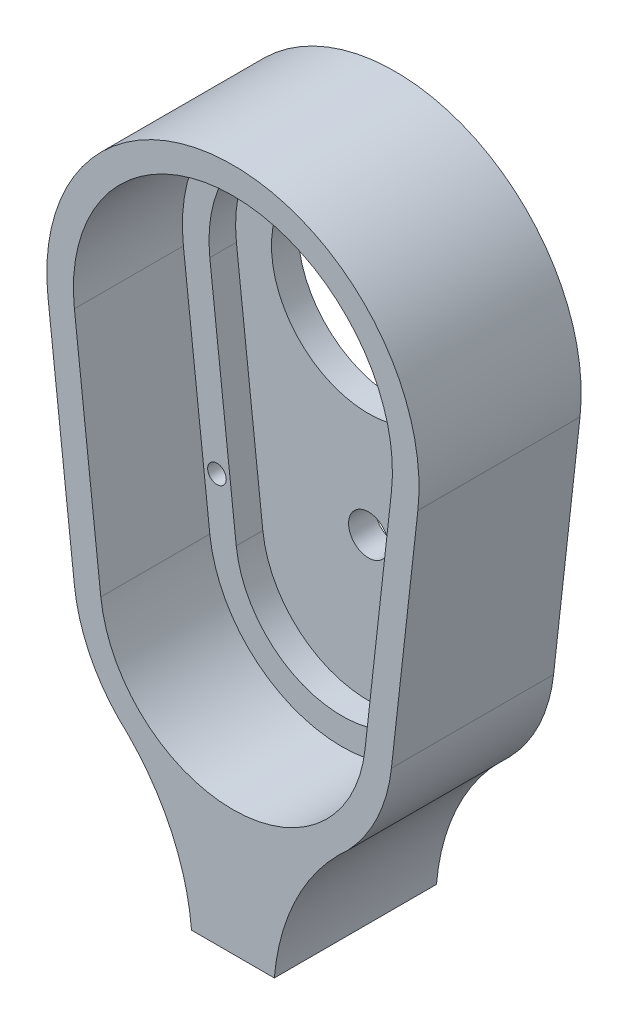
ISO-10303-21;
HEADER;
FILE_DESCRIPTION(('STEP AP214'),'2;1');
FILE_NAME('part.step','',(''),(''),'','','');
FILE_SCHEMA(('AUTOMOTIVE_DESIGN { 1 0 10303 214 1 1 1 1 }'));
ENDSEC;
DATA;
#1=APPLICATION_CONTEXT('core data for automotive mechanical design processes');
#2=APPLICATION_PROTOCOL_DEFINITION('international standard','automotive_design',2000,#1);
#3=PRODUCT_CONTEXT('',#1,'mechanical');
#4=PRODUCT('Part','Part','',(#3));
#5=PRODUCT_RELATED_PRODUCT_CATEGORY('part','',(#4));
#6=PRODUCT_DEFINITION_FORMATION('','',#4);
#7=PRODUCT_DEFINITION_CONTEXT('part definition',#1,'design');
#8=PRODUCT_DEFINITION('design','',#6,#7);
#9=PRODUCT_DEFINITION_SHAPE('','',#8);
#10=(LENGTH_UNIT() NAMED_UNIT(*) SI_UNIT(.MILLI.,.METRE.));
#11=(NAMED_UNIT(*) PLANE_ANGLE_UNIT() SI_UNIT($,.RADIAN.));
#12=(NAMED_UNIT(*) SI_UNIT($,.STERADIAN.) SOLID_ANGLE_UNIT());
#13=UNCERTAINTY_MEASURE_WITH_UNIT(LENGTH_MEASURE(1.E-05),#10,'distance_accuracy_value','');
#14=(GEOMETRIC_REPRESENTATION_CONTEXT(3) GLOBAL_UNCERTAINTY_ASSIGNED_CONTEXT((#13)) GLOBAL_UNIT_ASSIGNED_CONTEXT((#10,
#11,#12)) REPRESENTATION_CONTEXT('',''));
#15=CARTESIAN_POINT('',(0.,0.,0.));
#16=DIRECTION('',(0.,0.,1.));
#17=DIRECTION('',(1.,0.,0.));
#18=AXIS2_PLACEMENT_3D('',#15,#16,#17);
#19=CARTESIAN_POINT('',(0.,-22.86,15.494));
#20=DIRECTION('',(0.,0.,-1.));
#21=DIRECTION('',(-1.,0.,0.));
#22=AXIS2_PLACEMENT_3D('',#19,#20,#21);
#23=CYLINDRICAL_SURFACE('',#22,15.24);
#24=DIRECTION('',(0.,0.,-1.));
#25=VECTOR('',#24,1.);
#26=CARTESIAN_POINT('',(-10.046563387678,-34.319675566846,7.747));
#27=LINE('',#26,#25);
#28=CARTESIAN_POINT('',(-10.046563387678,-34.319675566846,15.494));
#29=VERTEX_POINT('',#28);
#30=CARTESIAN_POINT('',(-10.046563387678,-34.319675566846,0.));
#31=VERTEX_POINT('',#30);
#32=EDGE_CURVE('E62',#29,#31,#27,.T.);
#33=ORIENTED_EDGE('',*,*,#32,.F.);
#34=CARTESIAN_POINT('',(0.,-22.86,15.494));
#35=DIRECTION('',(0.,0.,1.));
#36=DIRECTION('',(1.,0.,0.));
#37=AXIS2_PLACEMENT_3D('',#34,#35,#36);
#38=CIRCLE('',#37,15.24);
#39=CARTESIAN_POINT('',(-15.1456337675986,-24.5533333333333,15.494));
#40=VERTEX_POINT('',#39);
#41=EDGE_CURVE('E265',#40,#29,#38,.T.);
#42=ORIENTED_EDGE('',*,*,#41,.F.);
#43=DIRECTION('',(0.,0.,-1.));
#44=VECTOR('',#43,1.);
#45=CARTESIAN_POINT('',(-15.1456337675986,-24.5533333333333,15.494));
#46=LINE('',#45,#44);
#47=CARTESIAN_POINT('',(-15.1456337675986,-24.5533333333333,0.));
#48=VERTEX_POINT('',#47);
#49=EDGE_CURVE('E46',#40,#48,#46,.T.);
#50=ORIENTED_EDGE('',*,*,#49,.T.);
#51=CARTESIAN_POINT('',(0.,-22.86,0.));
#52=DIRECTION('',(0.,0.,1.));
#53=DIRECTION('',(1.,0.,0.));
#54=AXIS2_PLACEMENT_3D('',#51,#52,#53);
#55=CIRCLE('',#54,15.24);
#56=EDGE_CURVE('E276',#48,#31,#55,.T.);
#57=ORIENTED_EDGE('',*,*,#56,.T.);
#58=EDGE_LOOP('',(#33,#42,#50,#57));
#59=FACE_BOUND('',#58,.T.);
#60=ADVANCED_FACE('F37',(#59),#23,.T.);
#61=CARTESIAN_POINT('',(0.,0.,2.54));
#62=DIRECTION('',(0.,0.,1.));
#63=DIRECTION('',(1.,0.,0.));
#64=AXIS2_PLACEMENT_3D('',#61,#62,#63);
#65=PLANE('',#64);
#66=CARTESIAN_POINT('',(0.,-19.304,2.54));
#67=DIRECTION('',(0.,0.,1.));
#68=DIRECTION('',(1.,0.,0.));
#69=AXIS2_PLACEMENT_3D('',#66,#67,#68);
#70=CIRCLE('',#69,1.905);
#71=CARTESIAN_POINT('',(1.905,-19.304,2.54));
#72=VERTEX_POINT('',#71);
#73=EDGE_CURVE('E665',#72,#72,#70,.T.);
#74=ORIENTED_EDGE('',*,*,#73,.F.);
#75=EDGE_LOOP('',(#74));
#76=FACE_BOUND('',#75,.T.);
#77=CARTESIAN_POINT('',(0.,0.,2.54));
#78=DIRECTION('',(0.,0.,1.));
#79=DIRECTION('',(1.,0.,0.));
#80=AXIS2_PLACEMENT_3D('',#77,#78,#79);
#81=CIRCLE('',#80,9.271);
#82=CARTESIAN_POINT('',(9.271,0.,2.54));
#83=VERTEX_POINT('',#82);
#84=EDGE_CURVE('E236',#83,#83,#81,.T.);
#85=ORIENTED_EDGE('',*,*,#84,.F.);
#86=EDGE_LOOP('',(#85));
#87=FACE_BOUND('',#86,.T.);
#88=CARTESIAN_POINT('',(0.,-22.86,2.54));
#89=DIRECTION('',(0.,0.,1.));
#90=DIRECTION('',(1.,0.,0.));
#91=AXIS2_PLACEMENT_3D('',#88,#89,#90);
#92=CIRCLE('',#91,10.16);
#93=CARTESIAN_POINT('',(-10.097089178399,-23.9888888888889,2.54));
#94=VERTEX_POINT('',#93);
#95=CARTESIAN_POINT('',(10.0970891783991,-23.9888888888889,2.54));
#96=VERTEX_POINT('',#95);
#97=EDGE_CURVE('E219',#94,#96,#92,.T.);
#98=ORIENTED_EDGE('',*,*,#97,.T.);
#99=DIRECTION('',(-0.111111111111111,-0.993807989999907,0.));
#100=VECTOR('',#99,1.);
#101=CARTESIAN_POINT('',(12.6213614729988,-1.41111111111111,2.54));
#102=LINE('',#101,#100);
#103=CARTESIAN_POINT('',(12.6213614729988,-1.4111111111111,2.54));
#104=VERTEX_POINT('',#103);
#105=EDGE_CURVE('E185',#104,#96,#102,.T.);
#106=ORIENTED_EDGE('',*,*,#105,.F.);
#107=CARTESIAN_POINT('',(0.,0.,2.54));
#108=DIRECTION('',(0.,0.,1.));
#109=DIRECTION('',(1.,0.,0.));
#110=AXIS2_PLACEMENT_3D('',#107,#108,#109);
#111=CIRCLE('',#110,12.7);
#112=CARTESIAN_POINT('',(-12.6213614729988,-1.41111111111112,2.54));
#113=VERTEX_POINT('',#112);
#114=EDGE_CURVE('E189',#104,#113,#111,.T.);
#115=ORIENTED_EDGE('',*,*,#114,.T.);
#116=DIRECTION('',(0.111111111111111,-0.993807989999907,0.));
#117=VECTOR('',#116,1.);
#118=CARTESIAN_POINT('',(-12.6213614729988,-1.41111111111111,2.54));
#119=LINE('',#118,#117);
#120=EDGE_CURVE('E221',#113,#94,#119,.T.);
#121=ORIENTED_EDGE('',*,*,#120,.T.);
#122=EDGE_LOOP('',(#98,#106,#115,#121));
#123=FACE_BOUND('',#122,.T.);
#124=ADVANCED_FACE('F317',(#76,#87,#123),#65,.T.);
#125=CARTESIAN_POINT('',(0.,0.,15.494));
#126=DIRECTION('',(0.,0.,-1.));
#127=DIRECTION('',(-1.,0.,0.));
#128=AXIS2_PLACEMENT_3D('',#125,#126,#127);
#129=CYLINDRICAL_SURFACE('',#128,17.78);
#130=CARTESIAN_POINT('',(0.,0.,0.));
#131=DIRECTION('',(0.,0.,1.));
#132=DIRECTION('',(1.,0.,0.));
#133=AXIS2_PLACEMENT_3D('',#130,#131,#132);
#134=CIRCLE('',#133,17.78);
#135=CARTESIAN_POINT('',(17.6699060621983,-1.97555555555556,0.));
#136=VERTEX_POINT('',#135);
#137=CARTESIAN_POINT('',(-17.6699060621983,-1.97555555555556,0.));
#138=VERTEX_POINT('',#137);
#139=EDGE_CURVE('E239',#136,#138,#134,.T.);
#140=ORIENTED_EDGE('',*,*,#139,.T.);
#141=DIRECTION('',(0.,0.,-1.));
#142=VECTOR('',#141,1.);
#143=CARTESIAN_POINT('',(-17.6699060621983,-1.97555555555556,15.494));
#144=LINE('',#143,#142);
#145=CARTESIAN_POINT('',(-17.6699060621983,-1.97555555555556,15.494));
#146=VERTEX_POINT('',#145);
#147=EDGE_CURVE('E11',#146,#138,#144,.T.);
#148=ORIENTED_EDGE('',*,*,#147,.F.);
#149=CARTESIAN_POINT('',(0.,0.,15.494));
#150=DIRECTION('',(0.,0.,1.));
#151=DIRECTION('',(1.,0.,0.));
#152=AXIS2_PLACEMENT_3D('',#149,#150,#151);
#153=CIRCLE('',#152,17.78);
#154=CARTESIAN_POINT('',(17.6699060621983,-1.97555555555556,15.494));
#155=VERTEX_POINT('',#154);
#156=EDGE_CURVE('E260',#155,#146,#153,.T.);
#157=ORIENTED_EDGE('',*,*,#156,.F.);
#158=DIRECTION('',(0.,0.,-1.));
#159=VECTOR('',#158,1.);
#160=CARTESIAN_POINT('',(17.6699060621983,-1.97555555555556,15.494));
#161=LINE('',#160,#159);
#162=EDGE_CURVE('E280',#155,#136,#161,.T.);
#163=ORIENTED_EDGE('',*,*,#162,.T.);
#164=EDGE_LOOP('',(#140,#148,#157,#163));
#165=FACE_BOUND('',#164,.T.);
#166=ADVANCED_FACE('F321',(#165),#129,.T.);
#167=CARTESIAN_POINT('',(-17.6699060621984,-1.97555555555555,15.494));
#168=DIRECTION('',(0.993807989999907,0.111111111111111,0.));
#169=DIRECTION('',(-0.111111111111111,0.993807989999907,0.));
#170=AXIS2_PLACEMENT_3D('',#167,#168,#169);
#171=PLANE('',#170);
#172=DIRECTION('',(0.111111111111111,-0.993807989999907,0.));
#173=VECTOR('',#172,1.);
#174=CARTESIAN_POINT('',(-17.6699060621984,-1.97555555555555,0.));
#175=LINE('',#174,#173);
#176=EDGE_CURVE('E273',#138,#48,#175,.T.);
#177=ORIENTED_EDGE('',*,*,#176,.T.);
#178=ORIENTED_EDGE('',*,*,#49,.F.);
#179=DIRECTION('',(0.111111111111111,-0.993807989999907,0.));
#180=VECTOR('',#179,1.);
#181=CARTESIAN_POINT('',(-17.6699060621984,-1.97555555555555,15.494));
#182=LINE('',#181,#180);
#183=EDGE_CURVE('E263',#146,#40,#182,.T.);
#184=ORIENTED_EDGE('',*,*,#183,.F.);
#185=ORIENTED_EDGE('',*,*,#147,.T.);
#186=EDGE_LOOP('',(#177,#178,#184,#185));
#187=FACE_BOUND('',#186,.T.);
#188=ADVANCED_FACE('F314',(#187),#171,.F.);
#189=CARTESIAN_POINT('',(10.0465633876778,-34.3196755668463,15.494));
#190=VERTEX_POINT('',#189);
#191=CARTESIAN_POINT('',(15.1456337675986,-24.5533333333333,15.494));
#192=VERTEX_POINT('',#191);
#193=EDGE_CURVE('E54',#190,#192,#38,.T.);
#194=ORIENTED_EDGE('',*,*,#193,.F.);
#195=DIRECTION('',(0.,0.,-1.));
#196=VECTOR('',#195,1.);
#197=CARTESIAN_POINT('',(10.0465633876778,-34.3196755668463,7.747));
#198=LINE('',#197,#196);
#199=CARTESIAN_POINT('',(10.0465633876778,-34.3196755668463,0.));
#200=VERTEX_POINT('',#199);
#201=EDGE_CURVE('E161',#190,#200,#198,.T.);
#202=ORIENTED_EDGE('',*,*,#201,.T.);
#203=CARTESIAN_POINT('',(15.1456337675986,-24.5533333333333,0.));
#204=VERTEX_POINT('',#203);
#205=EDGE_CURVE('E275',#200,#204,#55,.T.);
#206=ORIENTED_EDGE('',*,*,#205,.T.);
#207=DIRECTION('',(0.,0.,-1.));
#208=VECTOR('',#207,1.);
#209=CARTESIAN_POINT('',(15.1456337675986,-24.5533333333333,15.494));
#210=LINE('',#209,#208);
#211=EDGE_CURVE('E282',#192,#204,#210,.T.);
#212=ORIENTED_EDGE('',*,*,#211,.F.);
#213=EDGE_LOOP('',(#194,#202,#206,#212));
#214=FACE_BOUND('',#213,.T.);
#215=ADVANCED_FACE('F309',(#214),#23,.T.);
#216=CARTESIAN_POINT('',(-15.1456337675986,-1.69333333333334,15.494));
#217=DIRECTION('',(0.993807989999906,0.111111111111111,0.));
#218=DIRECTION('',(-0.111111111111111,0.993807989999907,0.));
#219=AXIS2_PLACEMENT_3D('',#216,#217,#218);
#220=PLANE('',#219);
#221=DIRECTION('',(0.111111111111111,-0.993807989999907,0.));
#222=VECTOR('',#221,1.);
#223=CARTESIAN_POINT('',(-15.1456337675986,-1.69333333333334,5.08));
#224=LINE('',#223,#222);
#225=CARTESIAN_POINT('',(-15.1456337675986,-1.69333333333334,5.08));
#226=VERTEX_POINT('',#225);
#227=CARTESIAN_POINT('',(-12.6213614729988,-24.2711111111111,5.08));
#228=VERTEX_POINT('',#227);
#229=EDGE_CURVE('E213',#226,#228,#224,.T.);
#230=ORIENTED_EDGE('',*,*,#229,.F.);
#231=DIRECTION('',(0.,0.,-1.));
#232=VECTOR('',#231,1.);
#233=CARTESIAN_POINT('',(-15.1456337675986,-1.69333333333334,15.494));
#234=LINE('',#233,#232);
#235=CARTESIAN_POINT('',(-15.1456337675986,-1.69333333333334,15.494));
#236=VERTEX_POINT('',#235);
#237=EDGE_CURVE('E41',#236,#226,#234,.T.);
#238=ORIENTED_EDGE('',*,*,#237,.F.);
#239=DIRECTION('',(0.111111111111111,-0.993807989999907,0.));
#240=VECTOR('',#239,1.);
#241=CARTESIAN_POINT('',(-15.1456337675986,-1.69333333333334,15.494));
#242=LINE('',#241,#240);
#243=CARTESIAN_POINT('',(-12.6213614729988,-24.2711111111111,15.494));
#244=VERTEX_POINT('',#243);
#245=EDGE_CURVE('E248',#236,#244,#242,.T.);
#246=ORIENTED_EDGE('',*,*,#245,.T.);
#247=DIRECTION('',(0.,0.,-1.));
#248=VECTOR('',#247,1.);
#249=CARTESIAN_POINT('',(-12.6213614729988,-24.2711111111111,15.494));
#250=LINE('',#249,#248);
#251=EDGE_CURVE('E270',#244,#228,#250,.T.);
#252=ORIENTED_EDGE('',*,*,#251,.T.);
#253=EDGE_LOOP('',(#230,#238,#246,#252));
#254=FACE_BOUND('',#253,.T.);
#255=ADVANCED_FACE('F39',(#254),#220,.T.);
#256=CARTESIAN_POINT('',(0.,0.,15.494));
#257=DIRECTION('',(0.,0.,-1.));
#258=DIRECTION('',(-1.,0.,0.));
#259=AXIS2_PLACEMENT_3D('',#256,#257,#258);
#260=CYLINDRICAL_SURFACE('',#259,15.24);
#261=CARTESIAN_POINT('',(0.,0.,5.08));
#262=DIRECTION('',(0.,0.,1.));
#263=DIRECTION('',(1.,0.,0.));
#264=AXIS2_PLACEMENT_3D('',#261,#262,#263);
#265=CIRCLE('',#264,15.24);
#266=CARTESIAN_POINT('',(15.1456337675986,-1.69333333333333,5.08));
#267=VERTEX_POINT('',#266);
#268=EDGE_CURVE('E210',#267,#226,#265,.T.);
#269=ORIENTED_EDGE('',*,*,#268,.F.);
#270=DIRECTION('',(0.,0.,-1.));
#271=VECTOR('',#270,1.);
#272=CARTESIAN_POINT('',(15.1456337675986,-1.69333333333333,15.494));
#273=LINE('',#272,#271);
#274=CARTESIAN_POINT('',(15.1456337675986,-1.69333333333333,15.494));
#275=VERTEX_POINT('',#274);
#276=EDGE_CURVE('E290',#275,#267,#273,.T.);
#277=ORIENTED_EDGE('',*,*,#276,.F.);
#278=CARTESIAN_POINT('',(0.,0.,15.494));
#279=DIRECTION('',(0.,0.,1.));
#280=DIRECTION('',(1.,0.,0.));
#281=AXIS2_PLACEMENT_3D('',#278,#279,#280);
#282=CIRCLE('',#281,15.24);
#283=EDGE_CURVE('E251',#275,#236,#282,.T.);
#284=ORIENTED_EDGE('',*,*,#283,.T.);
#285=ORIENTED_EDGE('',*,*,#237,.T.);
#286=EDGE_LOOP('',(#269,#277,#284,#285));
#287=FACE_BOUND('',#286,.T.);
#288=ADVANCED_FACE('F297',(#287),#260,.F.);
#289=CARTESIAN_POINT('',(15.1456337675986,-1.69333333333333,15.494));
#290=DIRECTION('',(0.993807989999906,-0.111111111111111,0.));
#291=DIRECTION('',(0.111111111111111,0.993807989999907,0.));
#292=AXIS2_PLACEMENT_3D('',#289,#290,#291);
#293=PLANE('',#292);
#294=ORIENTED_EDGE('',*,*,#276,.T.);
#295=DIRECTION('',(0.111111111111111,0.993807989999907,0.));
#296=VECTOR('',#295,1.);
#297=CARTESIAN_POINT('',(15.1456337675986,-1.69333333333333,5.08));
#298=LINE('',#297,#296);
#299=CARTESIAN_POINT('',(12.6213614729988,-24.2711111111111,5.08));
#300=VERTEX_POINT('',#299);
#301=EDGE_CURVE('E207',#300,#267,#298,.T.);
#302=ORIENTED_EDGE('',*,*,#301,.F.);
#303=DIRECTION('',(0.,0.,-1.));
#304=VECTOR('',#303,1.);
#305=CARTESIAN_POINT('',(12.6213614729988,-24.2711111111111,15.494));
#306=LINE('',#305,#304);
#307=CARTESIAN_POINT('',(12.6213614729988,-24.2711111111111,15.494));
#308=VERTEX_POINT('',#307);
#309=EDGE_CURVE('E289',#308,#300,#306,.T.);
#310=ORIENTED_EDGE('',*,*,#309,.F.);
#311=DIRECTION('',(-0.111111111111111,-0.993807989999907,0.));
#312=VECTOR('',#311,1.);
#313=CARTESIAN_POINT('',(15.1456337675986,-1.69333333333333,15.494));
#314=LINE('',#313,#312);
#315=EDGE_CURVE('E255',#275,#308,#314,.T.);
#316=ORIENTED_EDGE('',*,*,#315,.F.);
#317=EDGE_LOOP('',(#294,#302,#310,#316));
#318=FACE_BOUND('',#317,.T.);
#319=ADVANCED_FACE('F304',(#318),#293,.F.);
#320=CARTESIAN_POINT('',(0.,-22.86,15.494));
#321=DIRECTION('',(0.,0.,-1.));
#322=DIRECTION('',(-1.,0.,0.));
#323=AXIS2_PLACEMENT_3D('',#320,#321,#322);
#324=CYLINDRICAL_SURFACE('',#323,12.7);
#325=CARTESIAN_POINT('',(0.,-22.86,5.08));
#326=DIRECTION('',(0.,0.,1.));
#327=DIRECTION('',(1.,0.,0.));
#328=AXIS2_PLACEMENT_3D('',#325,#326,#327);
#329=CIRCLE('',#328,12.7);
#330=EDGE_CURVE('E204',#228,#300,#329,.T.);
#331=ORIENTED_EDGE('',*,*,#330,.F.);
#332=ORIENTED_EDGE('',*,*,#251,.F.);
#333=CARTESIAN_POINT('',(0.,-22.86,15.494));
#334=DIRECTION('',(0.,0.,1.));
#335=DIRECTION('',(1.,0.,0.));
#336=AXIS2_PLACEMENT_3D('',#333,#334,#335);
#337=CIRCLE('',#336,12.7);
#338=EDGE_CURVE('E257',#244,#308,#337,.T.);
#339=ORIENTED_EDGE('',*,*,#338,.T.);
#340=ORIENTED_EDGE('',*,*,#309,.T.);
#341=EDGE_LOOP('',(#331,#332,#339,#340));
#342=FACE_BOUND('',#341,.T.);
#343=ADVANCED_FACE('F307',(#342),#324,.F.);
#344=CARTESIAN_POINT('',(17.6699060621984,-1.97555555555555,15.494));
#345=DIRECTION('',(0.993807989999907,-0.111111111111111,0.));
#346=DIRECTION('',(0.111111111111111,0.993807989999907,0.));
#347=AXIS2_PLACEMENT_3D('',#344,#345,#346);
#348=PLANE('',#347);
#349=DIRECTION('',(-0.111111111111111,-0.993807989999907,0.));
#350=VECTOR('',#349,1.);
#351=CARTESIAN_POINT('',(17.6699060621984,-1.97555555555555,0.));
#352=LINE('',#351,#350);
#353=EDGE_CURVE('E252',#136,#204,#352,.T.);
#354=ORIENTED_EDGE('',*,*,#353,.F.);
#355=ORIENTED_EDGE('',*,*,#162,.F.);
#356=DIRECTION('',(-0.111111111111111,-0.993807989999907,0.));
#357=VECTOR('',#356,1.);
#358=CARTESIAN_POINT('',(17.6699060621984,-1.97555555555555,15.494));
#359=LINE('',#358,#357);
#360=EDGE_CURVE('E267',#155,#192,#359,.T.);
#361=ORIENTED_EDGE('',*,*,#360,.T.);
#362=ORIENTED_EDGE('',*,*,#211,.T.);
#363=EDGE_LOOP('',(#354,#355,#361,#362));
#364=FACE_BOUND('',#363,.T.);
#365=ADVANCED_FACE('F326',(#364),#348,.T.);
#366=CARTESIAN_POINT('',(0.,0.,15.494));
#367=DIRECTION('',(0.,0.,1.));
#368=DIRECTION('',(1.,0.,0.));
#369=AXIS2_PLACEMENT_3D('',#366,#367,#368);
#370=PLANE('',#369);
#371=ORIENTED_EDGE('',*,*,#41,.T.);
#372=CARTESIAN_POINT('',(-25.1573651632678,-49.2961369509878,15.494));
#373=DIRECTION('',(0.,0.,1.));
#374=DIRECTION('',(1.,0.,0.));
#375=AXIS2_PLACEMENT_3D('',#372,#373,#374);
#376=CIRCLE('',#375,21.2751198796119);
#377=CARTESIAN_POINT('',(-3.95720734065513,-47.5117507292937,15.494));
#378=VERTEX_POINT('',#377);
#379=EDGE_CURVE('E163',#29,#378,#376,.F.);
#380=ORIENTED_EDGE('',*,*,#379,.T.);
#381=DIRECTION('',(1.,0.,0.));
#382=VECTOR('',#381,1.);
#383=CARTESIAN_POINT('',(0.,-47.5117507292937,15.494));
#384=LINE('',#383,#382);
#385=CARTESIAN_POINT('',(3.9572073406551,-47.5117507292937,15.494));
#386=VERTEX_POINT('',#385);
#387=EDGE_CURVE('E164',#378,#386,#384,.T.);
#388=ORIENTED_EDGE('',*,*,#387,.T.);
#389=CARTESIAN_POINT('',(25.1573651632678,-49.2961369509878,15.494));
#390=DIRECTION('',(0.,0.,1.));
#391=DIRECTION('',(1.,0.,0.));
#392=AXIS2_PLACEMENT_3D('',#389,#390,#391);
#393=CIRCLE('',#392,21.2751198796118);
#394=EDGE_CURVE('E154',#190,#386,#393,.T.);
#395=ORIENTED_EDGE('',*,*,#394,.F.);
#396=ORIENTED_EDGE('',*,*,#193,.T.);
#397=ORIENTED_EDGE('',*,*,#360,.F.);
#398=ORIENTED_EDGE('',*,*,#156,.T.);
#399=ORIENTED_EDGE('',*,*,#183,.T.);
#400=EDGE_LOOP('',(#371,#380,#388,#395,#396,#397,#398,#399));
#401=FACE_BOUND('',#400,.T.);
#402=ORIENTED_EDGE('',*,*,#245,.F.);
#403=ORIENTED_EDGE('',*,*,#283,.F.);
#404=ORIENTED_EDGE('',*,*,#315,.T.);
#405=ORIENTED_EDGE('',*,*,#338,.F.);
#406=EDGE_LOOP('',(#402,#403,#404,#405));
#407=FACE_BOUND('',#406,.T.);
#408=ADVANCED_FACE('F167',(#401,#407),#370,.T.);
#409=CARTESIAN_POINT('',(0.,0.,0.));
#410=DIRECTION('',(0.,0.,1.));
#411=DIRECTION('',(1.,0.,0.));
#412=AXIS2_PLACEMENT_3D('',#409,#410,#411);
#413=PLANE('',#412);
#414=CARTESIAN_POINT('',(0.,-19.304,0.));
#415=DIRECTION('',(0.,0.,1.));
#416=DIRECTION('',(1.,0.,0.));
#417=AXIS2_PLACEMENT_3D('',#414,#415,#416);
#418=CIRCLE('',#417,1.905);
#419=CARTESIAN_POINT('',(1.905,-19.304,0.));
#420=VERTEX_POINT('',#419);
#421=EDGE_CURVE('E662',#420,#420,#418,.T.);
#422=ORIENTED_EDGE('',*,*,#421,.T.);
#423=EDGE_LOOP('',(#422));
#424=FACE_BOUND('',#423,.T.);
#425=ORIENTED_EDGE('',*,*,#205,.F.);
#426=CARTESIAN_POINT('',(25.1573651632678,-49.2961369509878,0.));
#427=DIRECTION('',(0.,0.,1.));
#428=DIRECTION('',(1.,0.,0.));
#429=AXIS2_PLACEMENT_3D('',#426,#427,#428);
#430=CIRCLE('',#429,21.2751198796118);
#431=CARTESIAN_POINT('',(3.9572073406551,-47.5117507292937,0.));
#432=VERTEX_POINT('',#431);
#433=EDGE_CURVE('E671',#200,#432,#430,.T.);
#434=ORIENTED_EDGE('',*,*,#433,.T.);
#435=DIRECTION('',(1.,0.,0.));
#436=VECTOR('',#435,1.);
#437=CARTESIAN_POINT('',(0.,-47.5117507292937,0.));
#438=LINE('',#437,#436);
#439=CARTESIAN_POINT('',(-3.95720734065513,-47.5117507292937,0.));
#440=VERTEX_POINT('',#439);
#441=EDGE_CURVE('E177',#440,#432,#438,.T.);
#442=ORIENTED_EDGE('',*,*,#441,.F.);
#443=CARTESIAN_POINT('',(-25.1573651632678,-49.2961369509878,0.));
#444=DIRECTION('',(0.,0.,1.));
#445=DIRECTION('',(1.,0.,0.));
#446=AXIS2_PLACEMENT_3D('',#443,#444,#445);
#447=CIRCLE('',#446,21.2751198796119);
#448=EDGE_CURVE('E173',#31,#440,#447,.F.);
#449=ORIENTED_EDGE('',*,*,#448,.F.);
#450=ORIENTED_EDGE('',*,*,#56,.F.);
#451=ORIENTED_EDGE('',*,*,#176,.F.);
#452=ORIENTED_EDGE('',*,*,#139,.F.);
#453=ORIENTED_EDGE('',*,*,#353,.T.);
#454=EDGE_LOOP('',(#425,#434,#442,#449,#450,#451,#452,#453));
#455=FACE_BOUND('',#454,.T.);
#456=CARTESIAN_POINT('',(-11.938,-18.9532819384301,0.));
#457=DIRECTION('',(0.,0.,1.));
#458=DIRECTION('',(1.,0.,0.));
#459=AXIS2_PLACEMENT_3D('',#456,#457,#458);
#460=CIRCLE('',#459,0.889000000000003);
#461=CARTESIAN_POINT('',(-11.049,-18.9532819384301,0.));
#462=VERTEX_POINT('',#461);
#463=EDGE_CURVE('E235',#462,#462,#460,.T.);
#464=ORIENTED_EDGE('',*,*,#463,.T.);
#465=EDGE_LOOP('',(#464));
#466=FACE_BOUND('',#465,.T.);
#467=CARTESIAN_POINT('',(11.938,-18.9532819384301,0.));
#468=DIRECTION('',(0.,0.,1.));
#469=DIRECTION('',(1.,0.,0.));
#470=AXIS2_PLACEMENT_3D('',#467,#468,#469);
#471=CIRCLE('',#470,0.889000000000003);
#472=CARTESIAN_POINT('',(12.827,-18.9532819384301,0.));
#473=VERTEX_POINT('',#472);
#474=EDGE_CURVE('E243',#473,#473,#471,.F.);
#475=ORIENTED_EDGE('',*,*,#474,.F.);
#476=EDGE_LOOP('',(#475));
#477=FACE_BOUND('',#476,.T.);
#478=CARTESIAN_POINT('',(0.,0.,0.));
#479=DIRECTION('',(0.,0.,1.));
#480=DIRECTION('',(1.,0.,0.));
#481=AXIS2_PLACEMENT_3D('',#478,#479,#480);
#482=CIRCLE('',#481,9.271);
#483=CARTESIAN_POINT('',(9.271,0.,0.));
#484=VERTEX_POINT('',#483);
#485=EDGE_CURVE('E240',#484,#484,#482,.T.);
#486=ORIENTED_EDGE('',*,*,#485,.T.);
#487=EDGE_LOOP('',(#486));
#488=FACE_BOUND('',#487,.T.);
#489=ADVANCED_FACE('F360',(#424,#455,#466,#477,#488),#413,.F.);
#490=CARTESIAN_POINT('',(11.938,-18.9532819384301,2.54));
#491=DIRECTION('',(0.,0.,-1.));
#492=DIRECTION('',(-1.,0.,0.));
#493=AXIS2_PLACEMENT_3D('',#490,#491,#492);
#494=CYLINDRICAL_SURFACE('',#493,0.889000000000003);
#495=ORIENTED_EDGE('',*,*,#474,.T.);
#496=EDGE_LOOP('',(#495));
#497=FACE_BOUND('',#496,.T.);
#498=CARTESIAN_POINT('',(11.938,-18.9532819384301,5.08));
#499=DIRECTION('',(0.,0.,1.));
#500=DIRECTION('',(1.,0.,0.));
#501=AXIS2_PLACEMENT_3D('',#498,#499,#500);
#502=CIRCLE('',#501,0.889000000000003);
#503=CARTESIAN_POINT('',(12.827,-18.9532819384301,5.08));
#504=VERTEX_POINT('',#503);
#505=EDGE_CURVE('E198',#504,#504,#502,.F.);
#506=ORIENTED_EDGE('',*,*,#505,.F.);
#507=EDGE_LOOP('',(#506));
#508=FACE_BOUND('',#507,.T.);
#509=ADVANCED_FACE('F369',(#497,#508),#494,.F.);
#510=CARTESIAN_POINT('',(-11.938,-18.9532819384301,2.54));
#511=DIRECTION('',(0.,0.,-1.));
#512=DIRECTION('',(-1.,0.,0.));
#513=AXIS2_PLACEMENT_3D('',#510,#511,#512);
#514=CYLINDRICAL_SURFACE('',#513,0.889000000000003);
#515=ORIENTED_EDGE('',*,*,#463,.F.);
#516=EDGE_LOOP('',(#515));
#517=FACE_BOUND('',#516,.T.);
#518=CARTESIAN_POINT('',(-11.938,-18.9532819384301,5.08));
#519=DIRECTION('',(0.,0.,1.));
#520=DIRECTION('',(1.,0.,0.));
#521=AXIS2_PLACEMENT_3D('',#518,#519,#520);
#522=CIRCLE('',#521,0.889000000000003);
#523=CARTESIAN_POINT('',(-11.049,-18.9532819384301,5.08));
#524=VERTEX_POINT('',#523);
#525=EDGE_CURVE('E201',#524,#524,#522,.F.);
#526=ORIENTED_EDGE('',*,*,#525,.F.);
#527=EDGE_LOOP('',(#526));
#528=FACE_BOUND('',#527,.T.);
#529=ADVANCED_FACE('F377',(#517,#528),#514,.F.);
#530=CARTESIAN_POINT('',(0.,0.,2.54));
#531=DIRECTION('',(0.,0.,-1.));
#532=DIRECTION('',(-1.,0.,0.));
#533=AXIS2_PLACEMENT_3D('',#530,#531,#532);
#534=CYLINDRICAL_SURFACE('',#533,9.271);
#535=ORIENTED_EDGE('',*,*,#84,.T.);
#536=EDGE_LOOP('',(#535));
#537=FACE_BOUND('',#536,.T.);
#538=ORIENTED_EDGE('',*,*,#485,.F.);
#539=EDGE_LOOP('',(#538));
#540=FACE_BOUND('',#539,.T.);
#541=ADVANCED_FACE('F385',(#537,#540),#534,.F.);
#542=CARTESIAN_POINT('',(12.6213614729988,-1.41111111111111,5.08));
#543=DIRECTION('',(0.993807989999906,-0.111111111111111,0.));
#544=DIRECTION('',(0.111111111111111,0.993807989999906,0.));
#545=AXIS2_PLACEMENT_3D('',#542,#543,#544);
#546=PLANE('',#545);
#547=ORIENTED_EDGE('',*,*,#105,.T.);
#548=DIRECTION('',(0.,0.,-1.));
#549=VECTOR('',#548,1.);
#550=CARTESIAN_POINT('',(10.097089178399,-23.9888888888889,5.08));
#551=LINE('',#550,#549);
#552=CARTESIAN_POINT('',(10.097089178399,-23.9888888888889,5.08));
#553=VERTEX_POINT('',#552);
#554=EDGE_CURVE('E232',#553,#96,#551,.T.);
#555=ORIENTED_EDGE('',*,*,#554,.F.);
#556=DIRECTION('',(-0.111111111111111,-0.993807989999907,0.));
#557=VECTOR('',#556,1.);
#558=CARTESIAN_POINT('',(12.6213614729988,-1.41111111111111,5.08));
#559=LINE('',#558,#557);
#560=CARTESIAN_POINT('',(12.6213614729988,-1.4111111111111,5.08));
#561=VERTEX_POINT('',#560);
#562=EDGE_CURVE('E186',#561,#553,#559,.T.);
#563=ORIENTED_EDGE('',*,*,#562,.F.);
#564=DIRECTION('',(0.,0.,-1.));
#565=VECTOR('',#564,1.);
#566=CARTESIAN_POINT('',(12.6213614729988,-1.4111111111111,5.08));
#567=LINE('',#566,#565);
#568=EDGE_CURVE('E216',#561,#104,#567,.T.);
#569=ORIENTED_EDGE('',*,*,#568,.T.);
#570=EDGE_LOOP('',(#547,#555,#563,#569));
#571=FACE_BOUND('',#570,.T.);
#572=ADVANCED_FACE('F393',(#571),#546,.F.);
#573=CARTESIAN_POINT('',(0.,-22.86,5.08));
#574=DIRECTION('',(0.,0.,-1.));
#575=DIRECTION('',(-1.,0.,0.));
#576=AXIS2_PLACEMENT_3D('',#573,#574,#575);
#577=CYLINDRICAL_SURFACE('',#576,10.16);
#578=ORIENTED_EDGE('',*,*,#97,.F.);
#579=DIRECTION('',(0.,0.,-1.));
#580=VECTOR('',#579,1.);
#581=CARTESIAN_POINT('',(-10.097089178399,-23.9888888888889,5.08));
#582=LINE('',#581,#580);
#583=CARTESIAN_POINT('',(-10.097089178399,-23.9888888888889,5.08));
#584=VERTEX_POINT('',#583);
#585=EDGE_CURVE('E229',#584,#94,#582,.T.);
#586=ORIENTED_EDGE('',*,*,#585,.F.);
#587=CARTESIAN_POINT('',(0.,-22.86,5.08));
#588=DIRECTION('',(0.,0.,1.));
#589=DIRECTION('',(1.,0.,0.));
#590=AXIS2_PLACEMENT_3D('',#587,#588,#589);
#591=CIRCLE('',#590,10.16);
#592=EDGE_CURVE('E188',#584,#553,#591,.T.);
#593=ORIENTED_EDGE('',*,*,#592,.T.);
#594=ORIENTED_EDGE('',*,*,#554,.T.);
#595=EDGE_LOOP('',(#578,#586,#593,#594));
#596=FACE_BOUND('',#595,.T.);
#597=ADVANCED_FACE('F400',(#596),#577,.F.);
#598=CARTESIAN_POINT('',(-12.6213614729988,-1.41111111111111,5.08));
#599=DIRECTION('',(0.993807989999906,0.111111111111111,0.));
#600=DIRECTION('',(-0.111111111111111,0.993807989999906,0.));
#601=AXIS2_PLACEMENT_3D('',#598,#599,#600);
#602=PLANE('',#601);
#603=ORIENTED_EDGE('',*,*,#120,.F.);
#604=DIRECTION('',(0.,0.,-1.));
#605=VECTOR('',#604,1.);
#606=CARTESIAN_POINT('',(-12.6213614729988,-1.41111111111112,5.08));
#607=LINE('',#606,#605);
#608=CARTESIAN_POINT('',(-12.6213614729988,-1.41111111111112,5.08));
#609=VERTEX_POINT('',#608);
#610=EDGE_CURVE('E226',#609,#113,#607,.T.);
#611=ORIENTED_EDGE('',*,*,#610,.F.);
#612=DIRECTION('',(0.111111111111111,-0.993807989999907,0.));
#613=VECTOR('',#612,1.);
#614=CARTESIAN_POINT('',(-12.6213614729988,-1.41111111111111,5.08));
#615=LINE('',#614,#613);
#616=EDGE_CURVE('E192',#609,#584,#615,.T.);
#617=ORIENTED_EDGE('',*,*,#616,.T.);
#618=ORIENTED_EDGE('',*,*,#585,.T.);
#619=EDGE_LOOP('',(#603,#611,#617,#618));
#620=FACE_BOUND('',#619,.T.);
#621=ADVANCED_FACE('F408',(#620),#602,.T.);
#622=CARTESIAN_POINT('',(0.,0.,5.08));
#623=DIRECTION('',(0.,0.,-1.));
#624=DIRECTION('',(-1.,0.,0.));
#625=AXIS2_PLACEMENT_3D('',#622,#623,#624);
#626=CYLINDRICAL_SURFACE('',#625,12.7);
#627=ORIENTED_EDGE('',*,*,#114,.F.);
#628=ORIENTED_EDGE('',*,*,#568,.F.);
#629=CARTESIAN_POINT('',(0.,0.,5.08));
#630=DIRECTION('',(0.,0.,1.));
#631=DIRECTION('',(1.,0.,0.));
#632=AXIS2_PLACEMENT_3D('',#629,#630,#631);
#633=CIRCLE('',#632,12.7);
#634=EDGE_CURVE('E195',#561,#609,#633,.T.);
#635=ORIENTED_EDGE('',*,*,#634,.T.);
#636=ORIENTED_EDGE('',*,*,#610,.T.);
#637=EDGE_LOOP('',(#627,#628,#635,#636));
#638=FACE_BOUND('',#637,.T.);
#639=ADVANCED_FACE('F416',(#638),#626,.F.);
#640=CARTESIAN_POINT('',(0.,0.,5.08));
#641=DIRECTION('',(0.,0.,1.));
#642=DIRECTION('',(1.,0.,0.));
#643=AXIS2_PLACEMENT_3D('',#640,#641,#642);
#644=PLANE('',#643);
#645=ORIENTED_EDGE('',*,*,#562,.T.);
#646=ORIENTED_EDGE('',*,*,#592,.F.);
#647=ORIENTED_EDGE('',*,*,#616,.F.);
#648=ORIENTED_EDGE('',*,*,#634,.F.);
#649=EDGE_LOOP('',(#645,#646,#647,#648));
#650=FACE_BOUND('',#649,.T.);
#651=ORIENTED_EDGE('',*,*,#505,.T.);
#652=EDGE_LOOP('',(#651));
#653=FACE_BOUND('',#652,.T.);
#654=ORIENTED_EDGE('',*,*,#525,.T.);
#655=EDGE_LOOP('',(#654));
#656=FACE_BOUND('',#655,.T.);
#657=ORIENTED_EDGE('',*,*,#330,.T.);
#658=ORIENTED_EDGE('',*,*,#301,.T.);
#659=ORIENTED_EDGE('',*,*,#268,.T.);
#660=ORIENTED_EDGE('',*,*,#229,.T.);
#661=EDGE_LOOP('',(#657,#658,#659,#660));
#662=FACE_BOUND('',#661,.T.);
#663=ADVANCED_FACE('F302',(#650,#653,#656,#662),#644,.T.);
#664=CARTESIAN_POINT('',(25.1573651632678,-49.2961369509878,15.494));
#665=DIRECTION('',(0.,0.,-1.));
#666=DIRECTION('',(-1.,0.,0.));
#667=AXIS2_PLACEMENT_3D('',#664,#665,#666);
#668=CYLINDRICAL_SURFACE('',#667,21.2751198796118);
#669=ORIENTED_EDGE('',*,*,#201,.F.);
#670=ORIENTED_EDGE('',*,*,#394,.T.);
#671=DIRECTION('',(0.,0.,-1.));
#672=VECTOR('',#671,1.);
#673=CARTESIAN_POINT('',(3.9572073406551,-47.5117507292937,15.494));
#674=LINE('',#673,#672);
#675=EDGE_CURVE('E159',#386,#432,#674,.T.);
#676=ORIENTED_EDGE('',*,*,#675,.T.);
#677=ORIENTED_EDGE('',*,*,#433,.F.);
#678=EDGE_LOOP('',(#669,#670,#676,#677));
#679=FACE_BOUND('',#678,.T.);
#680=ADVANCED_FACE('F156',(#679),#668,.F.);
#681=CARTESIAN_POINT('',(-25.1573651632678,-49.2961369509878,15.494));
#682=DIRECTION('',(0.,0.,-1.));
#683=DIRECTION('',(-1.,0.,0.));
#684=AXIS2_PLACEMENT_3D('',#681,#682,#683);
#685=CYLINDRICAL_SURFACE('',#684,21.2751198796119);
#686=ORIENTED_EDGE('',*,*,#379,.F.);
#687=ORIENTED_EDGE('',*,*,#32,.T.);
#688=ORIENTED_EDGE('',*,*,#448,.T.);
#689=DIRECTION('',(0.,0.,-1.));
#690=VECTOR('',#689,1.);
#691=CARTESIAN_POINT('',(-3.95720734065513,-47.5117507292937,15.494));
#692=LINE('',#691,#690);
#693=EDGE_CURVE('E178',#378,#440,#692,.T.);
#694=ORIENTED_EDGE('',*,*,#693,.F.);
#695=EDGE_LOOP('',(#686,#687,#688,#694));
#696=FACE_BOUND('',#695,.T.);
#697=ADVANCED_FACE('F437',(#696),#685,.F.);
#698=CARTESIAN_POINT('',(0.,-47.5117507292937,15.494));
#699=DIRECTION('',(0.,1.,0.));
#700=DIRECTION('',(0.,0.,1.));
#701=AXIS2_PLACEMENT_3D('',#698,#699,#700);
#702=PLANE('',#701);
#703=ORIENTED_EDGE('',*,*,#441,.T.);
#704=ORIENTED_EDGE('',*,*,#675,.F.);
#705=ORIENTED_EDGE('',*,*,#387,.F.);
#706=ORIENTED_EDGE('',*,*,#693,.T.);
#707=EDGE_LOOP('',(#703,#704,#705,#706));
#708=FACE_BOUND('',#707,.T.);
#709=ADVANCED_FACE('F175',(#708),#702,.F.);
#710=CARTESIAN_POINT('',(0.,-19.304,0.));
#711=DIRECTION('',(0.,0.,1.));
#712=DIRECTION('',(1.,0.,0.));
#713=AXIS2_PLACEMENT_3D('',#710,#711,#712);
#714=CYLINDRICAL_SURFACE('',#713,1.905);
#715=ORIENTED_EDGE('',*,*,#421,.F.);
#716=EDGE_LOOP('',(#715));
#717=FACE_BOUND('',#716,.T.);
#718=ORIENTED_EDGE('',*,*,#73,.T.);
#719=EDGE_LOOP('',(#718));
#720=FACE_BOUND('',#719,.T.);
#721=ADVANCED_FACE('F451',(#717,#720),#714,.F.);
#722=CLOSED_SHELL('',(#60,#124,#166,#188,#215,#255,#288,#319,#343,#365,#408,#489,#509,#529,#541,
#572,#597,#621,#639,#663,#680,#697,#709,#721));
#723=MANIFOLD_SOLID_BREP('B2',#722);
#724=ADVANCED_BREP_SHAPE_REPRESENTATION('',(#18,#723),#14);
#725=SHAPE_DEFINITION_REPRESENTATION(#9,#724);
ENDSEC;
END-ISO-10303-21;
